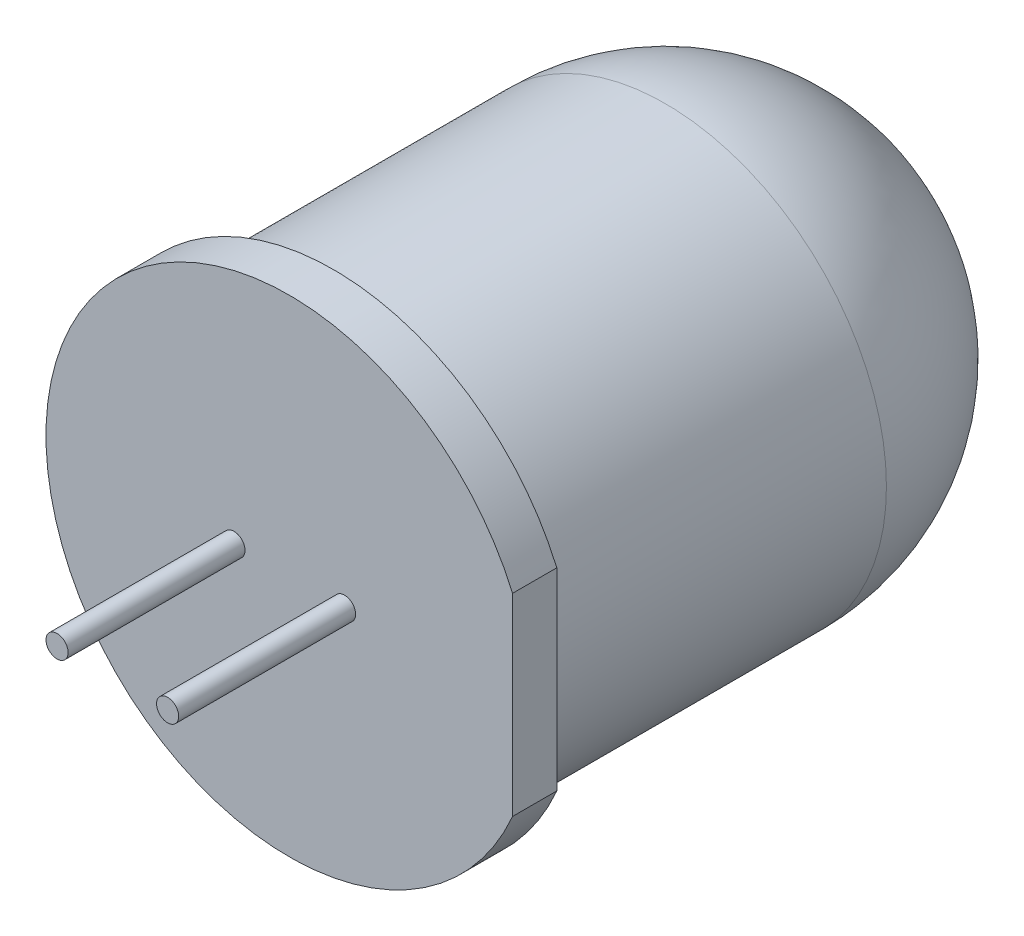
from build123d import *

# Parameters (mm, degrees)
ESQUISSE1_R          = 5
BASE_EXTRUSION_DEPTH = 13.5
BOSS_EXTRU_1_DEPTH   = 1
CONG_1_R             = 5
ESQUISSE3_R          = 0.25


with BuildPart() as part:
    # Esquisse1 → Base-Extrusion (new body)
    with BuildSketch(Plane.XY):
        Circle(ESQUISSE1_R)
    extrude(amount=BASE_EXTRUSION_DEPTH)

    # Esquisse2 → Boss.-Extru.1 (add)
    with BuildSketch(Plane.XY.offset(13.5)):
        with BuildLine():
            Line((5.047640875, 2.184335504), (5.047640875, -2.184335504))
            ThreePointArc((5.047640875, -2.184335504), (-5.5, 0), (5.047640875, 2.184335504))
        make_face()
    extrude(amount=-BOSS_EXTRU_1_DEPTH)

    # Cong_1
    cong_1_edges = [part.edges().sort_by_distance(p)[0] for p in [
        (-5, 0, 0),
    ]]
    fillet(cong_1_edges, radius=CONG_1_R)

    # Balayage1: sweep along a path in Esquisse4
    with BuildLine(Plane(origin=(-1.25, 0, 0), x_dir=(0, 0, -1), z_dir=(1, 0, 0))) as balayage1_path:
        Line((-13.5, 0), (-17.5, 0))
    # Esquisse3 → Balayage1 (sweep)
    with BuildSketch(Plane.XY.offset(13.5)):
        with Locations((-1.25, 0)):
            Circle(ESQUISSE3_R)
    balayage1 = sweep(path=balayage1_path.line)

    # Sym_trie1: Balayage1 across plane
    add(balayage1.mirror(Plane(origin=(0, 0, 0), x_dir=(0, 0, 1), z_dir=(1, 0, 0))))


solid = part.part
